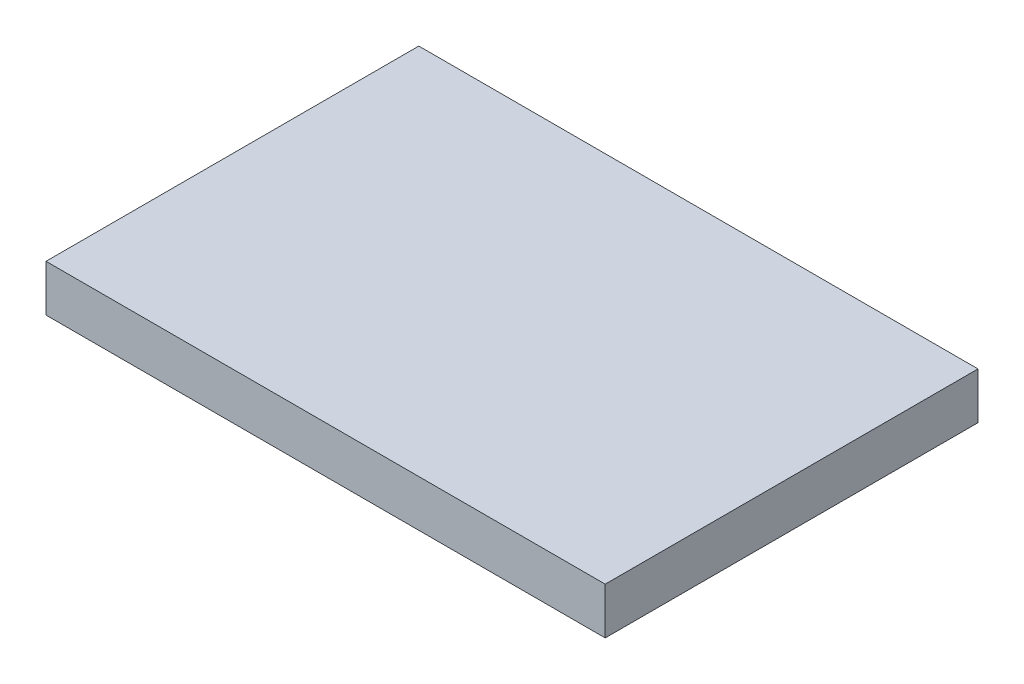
ISO-10303-21;
HEADER;
FILE_DESCRIPTION(('STEP AP214'),'2;1');
FILE_NAME('part.step','',(''),(''),'','','');
FILE_SCHEMA(('AUTOMOTIVE_DESIGN { 1 0 10303 214 1 1 1 1 }'));
ENDSEC;
DATA;
#1=APPLICATION_CONTEXT('core data for automotive mechanical design processes');
#2=APPLICATION_PROTOCOL_DEFINITION('international standard','automotive_design',2000,#1);
#3=PRODUCT_CONTEXT('',#1,'mechanical');
#4=PRODUCT('Part','Part','',(#3));
#5=PRODUCT_RELATED_PRODUCT_CATEGORY('part','',(#4));
#6=PRODUCT_DEFINITION_FORMATION('','',#4);
#7=PRODUCT_DEFINITION_CONTEXT('part definition',#1,'design');
#8=PRODUCT_DEFINITION('design','',#6,#7);
#9=PRODUCT_DEFINITION_SHAPE('','',#8);
#10=(LENGTH_UNIT() NAMED_UNIT(*) SI_UNIT(.MILLI.,.METRE.));
#11=(NAMED_UNIT(*) PLANE_ANGLE_UNIT() SI_UNIT($,.RADIAN.));
#12=(NAMED_UNIT(*) SI_UNIT($,.STERADIAN.) SOLID_ANGLE_UNIT());
#13=UNCERTAINTY_MEASURE_WITH_UNIT(LENGTH_MEASURE(1.E-05),#10,'distance_accuracy_value','');
#14=(GEOMETRIC_REPRESENTATION_CONTEXT(3) GLOBAL_UNCERTAINTY_ASSIGNED_CONTEXT((#13)) GLOBAL_UNIT_ASSIGNED_CONTEXT((#10,
#11,#12)) REPRESENTATION_CONTEXT('',''));
#15=CARTESIAN_POINT('',(0.,0.,0.));
#16=DIRECTION('',(0.,0.,1.));
#17=DIRECTION('',(1.,0.,0.));
#18=AXIS2_PLACEMENT_3D('',#15,#16,#17);
#19=CARTESIAN_POINT('',(0.,0.,101.6));
#20=DIRECTION('',(1.,0.,0.));
#21=DIRECTION('',(0.,0.,-1.));
#22=AXIS2_PLACEMENT_3D('',#19,#20,#21);
#23=PLANE('',#22);
#24=DIRECTION('',(0.,-1.,0.));
#25=VECTOR('',#24,1.);
#26=CARTESIAN_POINT('',(0.,0.,0.));
#27=LINE('',#26,#25);
#28=CARTESIAN_POINT('',(0.,12.7,0.));
#29=VERTEX_POINT('',#28);
#30=CARTESIAN_POINT('',(0.,0.,0.));
#31=VERTEX_POINT('',#30);
#32=EDGE_CURVE('E75',#29,#31,#27,.T.);
#33=ORIENTED_EDGE('',*,*,#32,.T.);
#34=DIRECTION('',(0.,0.,-1.));
#35=VECTOR('',#34,1.);
#36=CARTESIAN_POINT('',(0.,0.,101.6));
#37=LINE('',#36,#35);
#38=CARTESIAN_POINT('',(0.,0.,101.6));
#39=VERTEX_POINT('',#38);
#40=EDGE_CURVE('E11',#39,#31,#37,.T.);
#41=ORIENTED_EDGE('',*,*,#40,.F.);
#42=DIRECTION('',(0.,-1.,0.));
#43=VECTOR('',#42,1.);
#44=CARTESIAN_POINT('',(0.,0.,101.6));
#45=LINE('',#44,#43);
#46=CARTESIAN_POINT('',(0.,12.7,101.6));
#47=VERTEX_POINT('',#46);
#48=EDGE_CURVE('E93',#47,#39,#45,.T.);
#49=ORIENTED_EDGE('',*,*,#48,.F.);
#50=DIRECTION('',(0.,0.,-1.));
#51=VECTOR('',#50,1.);
#52=CARTESIAN_POINT('',(0.,12.7,101.6));
#53=LINE('',#52,#51);
#54=EDGE_CURVE('E87',#47,#29,#53,.T.);
#55=ORIENTED_EDGE('',*,*,#54,.T.);
#56=EDGE_LOOP('',(#33,#41,#49,#55));
#57=FACE_BOUND('',#56,.T.);
#58=ADVANCED_FACE('F31',(#57),#23,.F.);
#59=CARTESIAN_POINT('',(0.,0.,101.6));
#60=DIRECTION('',(0.,1.,0.));
#61=DIRECTION('',(0.,0.,1.));
#62=AXIS2_PLACEMENT_3D('',#59,#60,#61);
#63=PLANE('',#62);
#64=DIRECTION('',(1.,0.,0.));
#65=VECTOR('',#64,1.);
#66=CARTESIAN_POINT('',(0.,0.,0.));
#67=LINE('',#66,#65);
#68=CARTESIAN_POINT('',(152.4,0.,0.));
#69=VERTEX_POINT('',#68);
#70=EDGE_CURVE('E71',#31,#69,#67,.T.);
#71=ORIENTED_EDGE('',*,*,#70,.T.);
#72=DIRECTION('',(0.,0.,-1.));
#73=VECTOR('',#72,1.);
#74=CARTESIAN_POINT('',(152.4,0.,101.6));
#75=LINE('',#74,#73);
#76=CARTESIAN_POINT('',(152.4,0.,101.6));
#77=VERTEX_POINT('',#76);
#78=EDGE_CURVE('E38',#77,#69,#75,.T.);
#79=ORIENTED_EDGE('',*,*,#78,.F.);
#80=DIRECTION('',(1.,0.,0.));
#81=VECTOR('',#80,1.);
#82=CARTESIAN_POINT('',(0.,0.,101.6));
#83=LINE('',#82,#81);
#84=EDGE_CURVE('E83',#39,#77,#83,.T.);
#85=ORIENTED_EDGE('',*,*,#84,.F.);
#86=ORIENTED_EDGE('',*,*,#40,.T.);
#87=EDGE_LOOP('',(#71,#79,#85,#86));
#88=FACE_BOUND('',#87,.T.);
#89=ADVANCED_FACE('F82',(#88),#63,.F.);
#90=CARTESIAN_POINT('',(152.4,0.,101.6));
#91=DIRECTION('',(-1.,0.,0.));
#92=DIRECTION('',(0.,0.,1.));
#93=AXIS2_PLACEMENT_3D('',#90,#91,#92);
#94=PLANE('',#93);
#95=DIRECTION('',(0.,1.,0.));
#96=VECTOR('',#95,1.);
#97=CARTESIAN_POINT('',(152.4,0.,0.));
#98=LINE('',#97,#96);
#99=CARTESIAN_POINT('',(152.4,12.7,0.));
#100=VERTEX_POINT('',#99);
#101=EDGE_CURVE('E76',#69,#100,#98,.T.);
#102=ORIENTED_EDGE('',*,*,#101,.T.);
#103=DIRECTION('',(0.,0.,-1.));
#104=VECTOR('',#103,1.);
#105=CARTESIAN_POINT('',(152.4,12.7,101.6));
#106=LINE('',#105,#104);
#107=CARTESIAN_POINT('',(152.4,12.7,101.6));
#108=VERTEX_POINT('',#107);
#109=EDGE_CURVE('E99',#108,#100,#106,.T.);
#110=ORIENTED_EDGE('',*,*,#109,.F.);
#111=DIRECTION('',(0.,1.,0.));
#112=VECTOR('',#111,1.);
#113=CARTESIAN_POINT('',(152.4,0.,101.6));
#114=LINE('',#113,#112);
#115=EDGE_CURVE('E50',#77,#108,#114,.T.);
#116=ORIENTED_EDGE('',*,*,#115,.F.);
#117=ORIENTED_EDGE('',*,*,#78,.T.);
#118=EDGE_LOOP('',(#102,#110,#116,#117));
#119=FACE_BOUND('',#118,.T.);
#120=ADVANCED_FACE('F102',(#119),#94,.F.);
#121=CARTESIAN_POINT('',(0.,12.7,101.6));
#122=DIRECTION('',(0.,-1.,0.));
#123=DIRECTION('',(0.,0.,-1.));
#124=AXIS2_PLACEMENT_3D('',#121,#122,#123);
#125=PLANE('',#124);
#126=DIRECTION('',(-1.,0.,0.));
#127=VECTOR('',#126,1.);
#128=CARTESIAN_POINT('',(0.,12.7,0.));
#129=LINE('',#128,#127);
#130=EDGE_CURVE('E91',#100,#29,#129,.T.);
#131=ORIENTED_EDGE('',*,*,#130,.T.);
#132=ORIENTED_EDGE('',*,*,#54,.F.);
#133=DIRECTION('',(-1.,0.,0.));
#134=VECTOR('',#133,1.);
#135=CARTESIAN_POINT('',(0.,12.7,101.6));
#136=LINE('',#135,#134);
#137=EDGE_CURVE('E45',#108,#47,#136,.T.);
#138=ORIENTED_EDGE('',*,*,#137,.F.);
#139=ORIENTED_EDGE('',*,*,#109,.T.);
#140=EDGE_LOOP('',(#131,#132,#138,#139));
#141=FACE_BOUND('',#140,.T.);
#142=ADVANCED_FACE('F104',(#141),#125,.F.);
#143=CARTESIAN_POINT('',(0.,12.7,101.6));
#144=DIRECTION('',(0.,0.,-1.));
#145=DIRECTION('',(-1.,0.,0.));
#146=AXIS2_PLACEMENT_3D('',#143,#144,#145);
#147=PLANE('',#146);
#148=ORIENTED_EDGE('',*,*,#48,.T.);
#149=ORIENTED_EDGE('',*,*,#84,.T.);
#150=ORIENTED_EDGE('',*,*,#115,.T.);
#151=ORIENTED_EDGE('',*,*,#137,.T.);
#152=EDGE_LOOP('',(#148,#149,#150,#151));
#153=FACE_BOUND('',#152,.T.);
#154=ADVANCED_FACE('F105',(#153),#147,.F.);
#155=CARTESIAN_POINT('',(0.,12.7,0.));
#156=DIRECTION('',(0.,0.,-1.));
#157=DIRECTION('',(-1.,0.,0.));
#158=AXIS2_PLACEMENT_3D('',#155,#156,#157);
#159=PLANE('',#158);
#160=ORIENTED_EDGE('',*,*,#32,.F.);
#161=ORIENTED_EDGE('',*,*,#130,.F.);
#162=ORIENTED_EDGE('',*,*,#101,.F.);
#163=ORIENTED_EDGE('',*,*,#70,.F.);
#164=EDGE_LOOP('',(#160,#161,#162,#163));
#165=FACE_BOUND('',#164,.T.);
#166=ADVANCED_FACE('F72',(#165),#159,.T.);
#167=CLOSED_SHELL('',(#58,#89,#120,#142,#154,#166));
#168=MANIFOLD_SOLID_BREP('B2',#167);
#169=ADVANCED_BREP_SHAPE_REPRESENTATION('',(#18,#168),#14);
#170=SHAPE_DEFINITION_REPRESENTATION(#9,#169);
ENDSEC;
END-ISO-10303-21;
